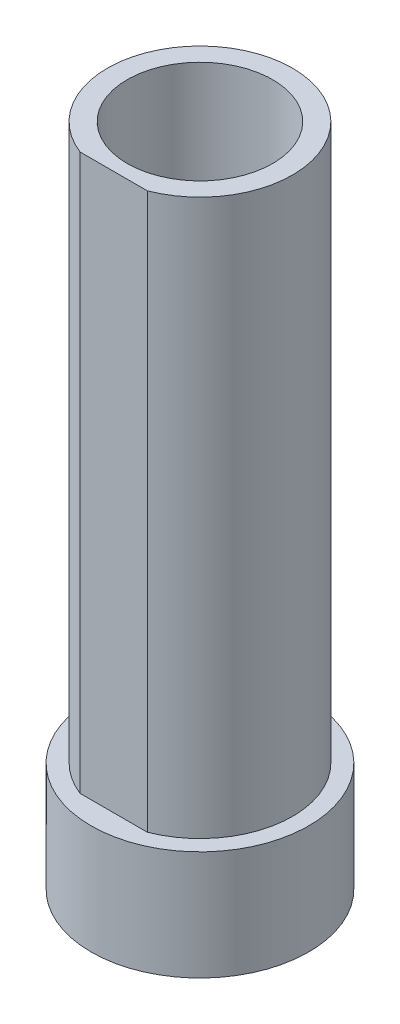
ISO-10303-21;
HEADER;
FILE_DESCRIPTION(('STEP AP214'),'2;1');
FILE_NAME('part.step','',(''),(''),'','','');
FILE_SCHEMA(('AUTOMOTIVE_DESIGN { 1 0 10303 214 1 1 1 1 }'));
ENDSEC;
DATA;
#1=APPLICATION_CONTEXT('core data for automotive mechanical design processes');
#2=APPLICATION_PROTOCOL_DEFINITION('international standard','automotive_design',2000,#1);
#3=PRODUCT_CONTEXT('',#1,'mechanical');
#4=PRODUCT('Part','Part','',(#3));
#5=PRODUCT_RELATED_PRODUCT_CATEGORY('part','',(#4));
#6=PRODUCT_DEFINITION_FORMATION('','',#4);
#7=PRODUCT_DEFINITION_CONTEXT('part definition',#1,'design');
#8=PRODUCT_DEFINITION('design','',#6,#7);
#9=PRODUCT_DEFINITION_SHAPE('','',#8);
#10=(LENGTH_UNIT() NAMED_UNIT(*) SI_UNIT(.MILLI.,.METRE.));
#11=(NAMED_UNIT(*) PLANE_ANGLE_UNIT() SI_UNIT($,.RADIAN.));
#12=(NAMED_UNIT(*) SI_UNIT($,.STERADIAN.) SOLID_ANGLE_UNIT());
#13=UNCERTAINTY_MEASURE_WITH_UNIT(LENGTH_MEASURE(1.E-05),#10,'distance_accuracy_value','');
#14=(GEOMETRIC_REPRESENTATION_CONTEXT(3) GLOBAL_UNCERTAINTY_ASSIGNED_CONTEXT((#13)) GLOBAL_UNIT_ASSIGNED_CONTEXT((#10,
#11,#12)) REPRESENTATION_CONTEXT('',''));
#15=CARTESIAN_POINT('',(0.,0.,0.));
#16=DIRECTION('',(0.,0.,1.));
#17=DIRECTION('',(1.,0.,0.));
#18=AXIS2_PLACEMENT_3D('',#15,#16,#17);
#19=CARTESIAN_POINT('',(0.,61.5,0.));
#20=DIRECTION('',(0.,1.,0.));
#21=DIRECTION('',(0.,0.,1.));
#22=AXIS2_PLACEMENT_3D('',#19,#20,#21);
#23=PLANE('',#22);
#24=CARTESIAN_POINT('',(0.,61.5,0.));
#25=DIRECTION('',(0.,1.,0.));
#26=DIRECTION('',(0.,0.,1.));
#27=AXIS2_PLACEMENT_3D('',#24,#25,#26);
#28=CIRCLE('',#27,10.25);
#29=CARTESIAN_POINT('',(3.72290209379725,61.5,9.55));
#30=VERTEX_POINT('',#29);
#31=CARTESIAN_POINT('',(-3.72290209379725,61.5,9.55));
#32=VERTEX_POINT('',#31);
#33=EDGE_CURVE('E68',#30,#32,#28,.T.);
#34=ORIENTED_EDGE('',*,*,#33,.T.);
#35=DIRECTION('',(1.,0.,0.));
#36=VECTOR('',#35,1.);
#37=CARTESIAN_POINT('',(-3.72290209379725,61.5,9.55));
#38=LINE('',#37,#36);
#39=EDGE_CURVE('E47',#32,#30,#38,.T.);
#40=ORIENTED_EDGE('',*,*,#39,.T.);
#41=EDGE_LOOP('',(#34,#40));
#42=FACE_BOUND('',#41,.T.);
#43=CARTESIAN_POINT('',(0.,61.5,0.));
#44=DIRECTION('',(0.,1.,0.));
#45=DIRECTION('',(0.,0.,1.));
#46=AXIS2_PLACEMENT_3D('',#43,#44,#45);
#47=CIRCLE('',#46,8.05);
#48=CARTESIAN_POINT('',(0.,61.5,8.05));
#49=VERTEX_POINT('',#48);
#50=EDGE_CURVE('E63',#49,#49,#47,.T.);
#51=ORIENTED_EDGE('',*,*,#50,.F.);
#52=EDGE_LOOP('',(#51));
#53=FACE_BOUND('',#52,.T.);
#54=ADVANCED_FACE('F32',(#42,#53),#23,.T.);
#55=CARTESIAN_POINT('',(0.,61.5,0.));
#56=DIRECTION('',(0.,-1.,0.));
#57=DIRECTION('',(0.,0.,-1.));
#58=AXIS2_PLACEMENT_3D('',#55,#56,#57);
#59=CYLINDRICAL_SURFACE('',#58,10.25);
#60=CARTESIAN_POINT('',(0.,0.,0.));
#61=DIRECTION('',(0.,1.,0.));
#62=DIRECTION('',(0.,0.,1.));
#63=AXIS2_PLACEMENT_3D('',#60,#61,#62);
#64=CIRCLE('',#63,10.25);
#65=CARTESIAN_POINT('',(3.72290209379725,0.,9.55));
#66=VERTEX_POINT('',#65);
#67=CARTESIAN_POINT('',(-3.72290209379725,0.,9.55));
#68=VERTEX_POINT('',#67);
#69=EDGE_CURVE('E58',#66,#68,#64,.T.);
#70=ORIENTED_EDGE('',*,*,#69,.T.);
#71=DIRECTION('',(0.,-1.,0.));
#72=VECTOR('',#71,1.);
#73=CARTESIAN_POINT('',(-3.72290209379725,61.5,9.55));
#74=LINE('',#73,#72);
#75=EDGE_CURVE('E11',#32,#68,#74,.T.);
#76=ORIENTED_EDGE('',*,*,#75,.F.);
#77=ORIENTED_EDGE('',*,*,#33,.F.);
#78=DIRECTION('',(0.,-1.,0.));
#79=VECTOR('',#78,1.);
#80=CARTESIAN_POINT('',(3.72290209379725,61.5,9.55));
#81=LINE('',#80,#79);
#82=EDGE_CURVE('E41',#30,#66,#81,.T.);
#83=ORIENTED_EDGE('',*,*,#82,.T.);
#84=EDGE_LOOP('',(#70,#76,#77,#83));
#85=FACE_BOUND('',#84,.T.);
#86=ADVANCED_FACE('F34',(#85),#59,.T.);
#87=CARTESIAN_POINT('',(-3.72290209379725,61.5,9.55));
#88=DIRECTION('',(0.,0.,-1.));
#89=DIRECTION('',(-1.,0.,0.));
#90=AXIS2_PLACEMENT_3D('',#87,#88,#89);
#91=PLANE('',#90);
#92=DIRECTION('',(1.,0.,0.));
#93=VECTOR('',#92,1.);
#94=CARTESIAN_POINT('',(-3.72290209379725,0.,9.55));
#95=LINE('',#94,#93);
#96=EDGE_CURVE('E56',#68,#66,#95,.T.);
#97=ORIENTED_EDGE('',*,*,#96,.T.);
#98=ORIENTED_EDGE('',*,*,#82,.F.);
#99=ORIENTED_EDGE('',*,*,#39,.F.);
#100=ORIENTED_EDGE('',*,*,#75,.T.);
#101=EDGE_LOOP('',(#97,#98,#99,#100));
#102=FACE_BOUND('',#101,.T.);
#103=ADVANCED_FACE('F66',(#102),#91,.F.);
#104=CARTESIAN_POINT('',(0.,61.5,0.));
#105=DIRECTION('',(0.,-1.,0.));
#106=DIRECTION('',(0.,0.,-1.));
#107=AXIS2_PLACEMENT_3D('',#104,#105,#106);
#108=CYLINDRICAL_SURFACE('',#107,8.05);
#109=ORIENTED_EDGE('',*,*,#50,.T.);
#110=EDGE_LOOP('',(#109));
#111=FACE_BOUND('',#110,.T.);
#112=CARTESIAN_POINT('',(0.,0.,0.));
#113=DIRECTION('',(0.,1.,0.));
#114=DIRECTION('',(0.,0.,1.));
#115=AXIS2_PLACEMENT_3D('',#112,#113,#114);
#116=CIRCLE('',#115,8.05);
#117=CARTESIAN_POINT('',(0.,0.,8.05));
#118=VERTEX_POINT('',#117);
#119=EDGE_CURVE('E73',#118,#118,#116,.T.);
#120=ORIENTED_EDGE('',*,*,#119,.F.);
#121=EDGE_LOOP('',(#120));
#122=FACE_BOUND('',#121,.T.);
#123=ADVANCED_FACE('F103',(#111,#122),#108,.F.);
#124=CARTESIAN_POINT('',(0.,0.,0.));
#125=DIRECTION('',(0.,1.,0.));
#126=DIRECTION('',(0.,0.,1.));
#127=AXIS2_PLACEMENT_3D('',#124,#125,#126);
#128=PLANE('',#127);
#129=ORIENTED_EDGE('',*,*,#119,.T.);
#130=EDGE_LOOP('',(#129));
#131=FACE_BOUND('',#130,.T.);
#132=ADVANCED_FACE('F108',(#131),#128,.T.);
#133=CARTESIAN_POINT('',(0.,0.,0.));
#134=DIRECTION('',(0.,1.,0.));
#135=DIRECTION('',(0.,0.,1.));
#136=AXIS2_PLACEMENT_3D('',#133,#134,#135);
#137=CIRCLE('',#136,12.05);
#138=CARTESIAN_POINT('',(0.,0.,12.05));
#139=VERTEX_POINT('',#138);
#140=EDGE_CURVE('E79',#139,#139,#137,.T.);
#141=ORIENTED_EDGE('',*,*,#140,.T.);
#142=EDGE_LOOP('',(#141));
#143=FACE_BOUND('',#142,.T.);
#144=ORIENTED_EDGE('',*,*,#69,.F.);
#145=ORIENTED_EDGE('',*,*,#96,.F.);
#146=EDGE_LOOP('',(#144,#145));
#147=FACE_BOUND('',#146,.T.);
#148=ADVANCED_FACE('F59',(#143,#147),#128,.T.);
#149=CARTESIAN_POINT('',(0.,-12.1,0.));
#150=DIRECTION('',(0.,1.,0.));
#151=DIRECTION('',(0.,0.,1.));
#152=AXIS2_PLACEMENT_3D('',#149,#150,#151);
#153=CYLINDRICAL_SURFACE('',#152,12.05);
#154=CARTESIAN_POINT('',(0.,-12.1,0.));
#155=DIRECTION('',(0.,1.,0.));
#156=DIRECTION('',(0.,0.,1.));
#157=AXIS2_PLACEMENT_3D('',#154,#155,#156);
#158=CIRCLE('',#157,12.05);
#159=CARTESIAN_POINT('',(0.,-12.1,12.05));
#160=VERTEX_POINT('',#159);
#161=EDGE_CURVE('E76',#160,#160,#158,.T.);
#162=ORIENTED_EDGE('',*,*,#161,.T.);
#163=EDGE_LOOP('',(#162));
#164=FACE_BOUND('',#163,.T.);
#165=ORIENTED_EDGE('',*,*,#140,.F.);
#166=EDGE_LOOP('',(#165));
#167=FACE_BOUND('',#166,.T.);
#168=ADVANCED_FACE('F85',(#164,#167),#153,.T.);
#169=CARTESIAN_POINT('',(0.,-12.1,0.));
#170=DIRECTION('',(0.,1.,0.));
#171=DIRECTION('',(0.,0.,1.));
#172=AXIS2_PLACEMENT_3D('',#169,#170,#171);
#173=PLANE('',#172);
#174=ORIENTED_EDGE('',*,*,#161,.F.);
#175=EDGE_LOOP('',(#174));
#176=FACE_BOUND('',#175,.T.);
#177=ADVANCED_FACE('F88',(#176),#173,.F.);
#178=CLOSED_SHELL('',(#54,#86,#103,#123,#132,#148,#168,#177));
#179=MANIFOLD_SOLID_BREP('B2',#178);
#180=ADVANCED_BREP_SHAPE_REPRESENTATION('',(#18,#179),#14);
#181=SHAPE_DEFINITION_REPRESENTATION(#9,#180);
ENDSEC;
END-ISO-10303-21;
